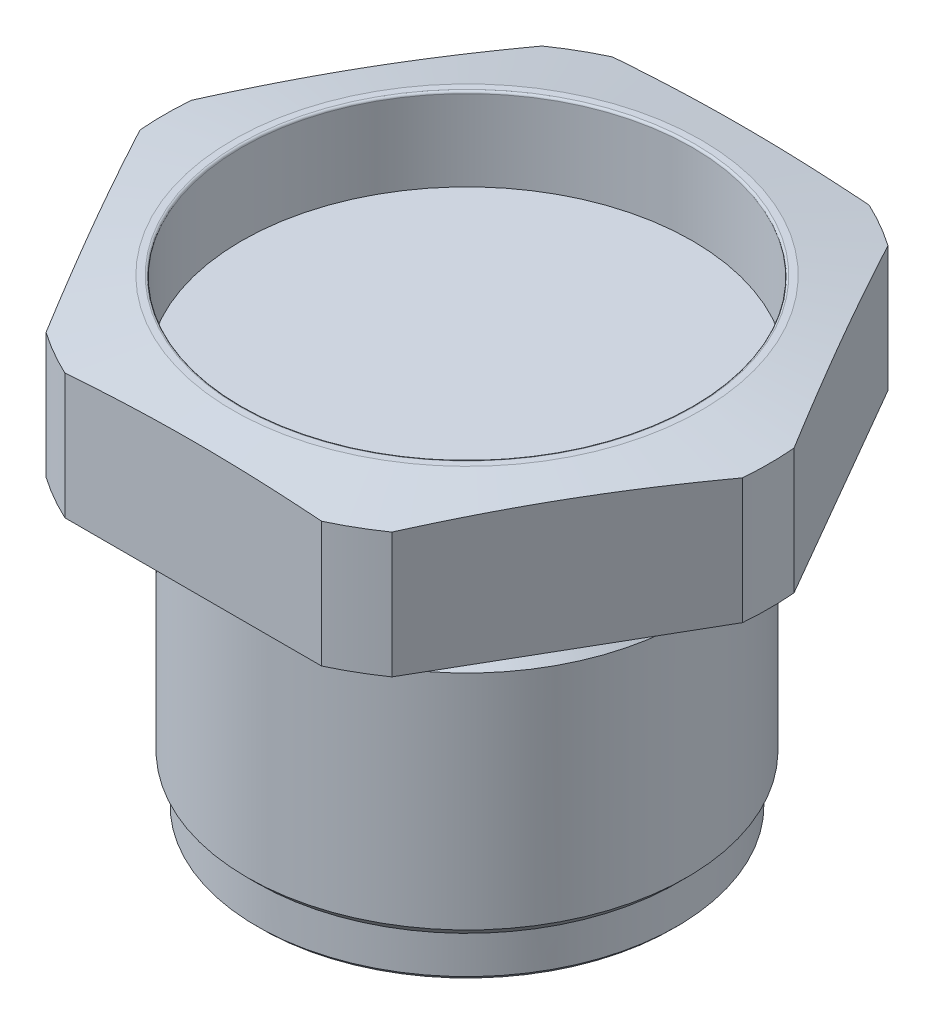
from build123d import *

# Parameters (mm, degrees)
FILLET7_R          = 0.25
SKETCH7_OUTSIDE_W  = 94.32
SKETCH7_OUTSIDE_H  = 94.32
CUT_EXTRUDE5_DEPTH = 63.100657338
CHAMFER2_SIZE      = 0.49999776
FILLET8_R          = 0.508
SKETCH9_W          = 9.0043
SKETCH9_H          = 1.3716


with BuildPart() as part:
    # Sketch6 → Revolve3 (revolve)
    with BuildSketch(Plane.XY, mode=Mode.PRIVATE) as revolve3_sk:
        Polygon((26.035, 15.875), (27.051, 15.875), (34.925, 14.486601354), (34.925, 0), (24.257, 0), (24.257, -37.6428), (0, -37.6428), (0, 6.2992), (26.035, 6.2992), align=None)
    revolve(revolve3_sk.sketch.rotate(Axis((0, -8.968942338, 0), (0, 1, 0)), 90), axis=Axis((0, -8.968942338, 0), (0, 1, 0)))

    # Fillet7
    fillet7_edges = [part.edges().sort_by_distance(p)[0] for p in [
        (0, 15.875, 26.035),
    ]]
    fillet(fillet7_edges, radius=FILLET7_R)

    # Sketch7 outside → Cut-Extrude5 (cut, through all)
    with BuildSketch(Plane.XZ):
        Rectangle(SKETCH7_OUTSIDE_W, SKETCH7_OUTSIDE_H)
        Polygon((-18.257547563, 31.623), (18.257547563, 31.623), (36.515095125, 0), (18.257547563, -31.623), (-18.257547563, -31.623), (-36.515095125, 0), align=None, mode=Mode.SUBTRACT)
    extrude(amount=-CUT_EXTRUDE5_DEPTH, mode=Mode.SUBTRACT)

    # Chamfer2
    chamfer2_edges = [part.edges().sort_by_distance(p)[0] for p in [
        (0, -37.6428, 24.257),
    ]]
    chamfer(chamfer2_edges, length=CHAMFER2_SIZE)

    # Sketch8 → Revolve4 (revolve)
    with BuildSketch(Plane.XY, mode=Mode.PRIVATE) as revolve4_sk:
        Polygon((-24.257, -4.826), (-24.257, -32.8168), (-25.4, -31.6738), (-25.4, -5.969), align=None)
    revolve(revolve4_sk.sketch.rotate(Axis((0, 0, 0), (0, -1, 0)), 90), axis=Axis((0, 0, 0), (0, -1, 0)))

    # Fillet8
    fillet8_edges = [part.edges().sort_by_distance(p)[0] for p in [
        (0, 0, 24.257),
    ]]
    fillet(fillet8_edges, radius=FILLET8_R)

    # Sketch9 → Cut-Revolve1 (revolve, cut)
    with BuildSketch(Plane.XY, mode=Mode.PRIVATE) as cut_revolve1_sk:
        with Locations((4.50215, -36.957)):
            Rectangle(SKETCH9_W, SKETCH9_H)
        with BuildLine():
            Line((10.9728, -37.6428), (10.9728, -37.1602))
            ThreePointArc((10.9728, -37.1602), (11.009141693, -37.411784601), (11.115195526, -37.6428))
            Line((11.115195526, -37.6428), (10.9728, -37.6428))
        make_face()
        with BuildLine():
            Line((12.7508, -37.1602), (12.7508, -37.6428))
            Line((12.7508, -37.6428), (12.608404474, -37.6428))
            ThreePointArc((12.608404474, -37.6428), (12.714458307, -37.411784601), (12.7508, -37.1602))
        make_face()
        with BuildLine():
            Line((15.7226, -36.2712), (21.3868, -36.2712))
            ThreePointArc((21.3868, -36.2712), (20.605982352, -36.735176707), (20.640195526, -37.6428))
            Line((20.640195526, -37.6428), (14.351, -37.6428))
            ThreePointArc((14.351, -37.6428), (14.752732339, -36.672932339), (15.7226, -36.2712))
        make_face()
    revolve(cut_revolve1_sk.sketch.rotate(Axis((0, 0, 0), (0, -1, 0)), 180), axis=Axis((0, 0, 0), (0, -1, 0)), mode=Mode.SUBTRACT)

    # Sketch10 → Revolve6 (revolve)
    with BuildSketch(Plane.XY, mode=Mode.PRIVATE) as revolve6_sk:
        with BuildLine():
            Line((-22.156362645, -37.605277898), (-20.617237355, -37.605277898))
            ThreePointArc((-20.617237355, -37.605277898), (-21.3868, -38.0492), (-22.156362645, -37.605277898))
        make_face()
        with BuildLine():
            Line((-12.631362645, -37.605277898), (-11.092237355, -37.605277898))
            ThreePointArc((-11.092237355, -37.605277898), (-11.8618, -38.0492), (-12.631362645, -37.605277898))
        make_face()
    revolve(revolve6_sk.sketch.rotate(Axis((0, 0, 0), (0, -1, 0)), 270), axis=Axis((0, 0, 0), (0, -1, 0)))


solid = part.part
